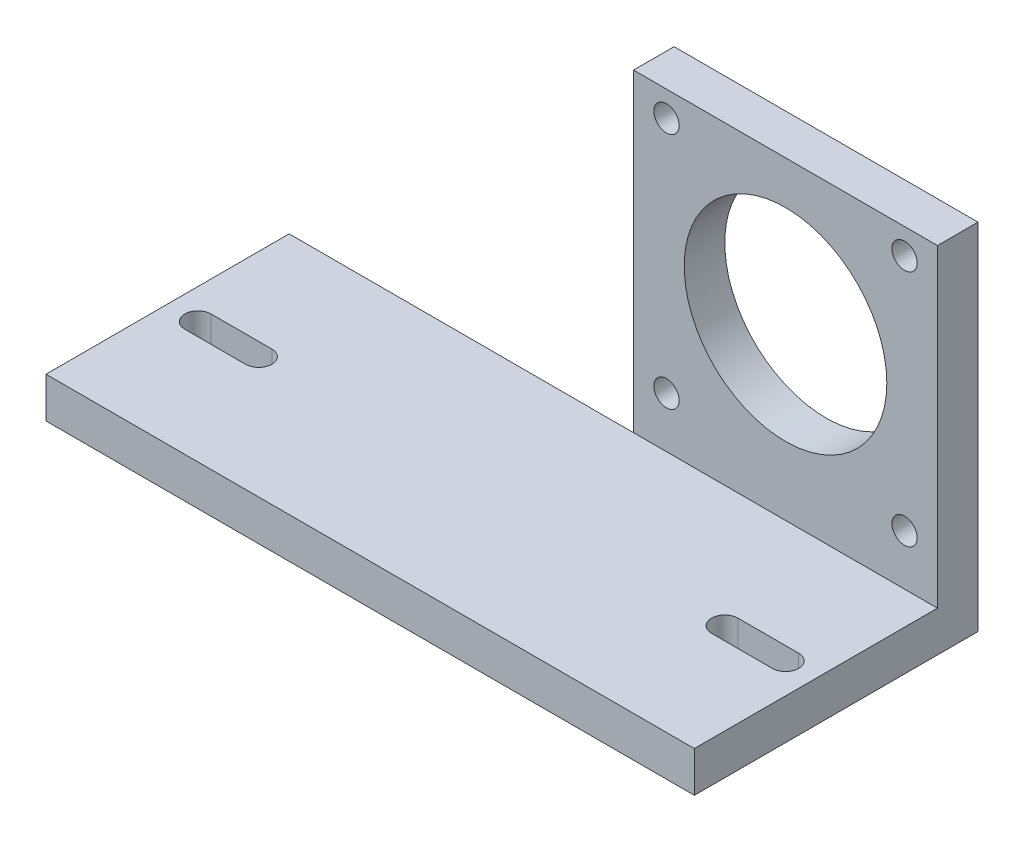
ISO-10303-21;
HEADER;
FILE_DESCRIPTION(('STEP AP214'),'2;1');
FILE_NAME('part.step','',(''),(''),'','','');
FILE_SCHEMA(('AUTOMOTIVE_DESIGN { 1 0 10303 214 1 1 1 1 }'));
ENDSEC;
DATA;
#1=APPLICATION_CONTEXT('core data for automotive mechanical design processes');
#2=APPLICATION_PROTOCOL_DEFINITION('international standard','automotive_design',2000,#1);
#3=PRODUCT_CONTEXT('',#1,'mechanical');
#4=PRODUCT('Part','Part','',(#3));
#5=PRODUCT_RELATED_PRODUCT_CATEGORY('part','',(#4));
#6=PRODUCT_DEFINITION_FORMATION('','',#4);
#7=PRODUCT_DEFINITION_CONTEXT('part definition',#1,'design');
#8=PRODUCT_DEFINITION('design','',#6,#7);
#9=PRODUCT_DEFINITION_SHAPE('','',#8);
#10=(LENGTH_UNIT() NAMED_UNIT(*) SI_UNIT(.MILLI.,.METRE.));
#11=(NAMED_UNIT(*) PLANE_ANGLE_UNIT() SI_UNIT($,.RADIAN.));
#12=(NAMED_UNIT(*) SI_UNIT($,.STERADIAN.) SOLID_ANGLE_UNIT());
#13=UNCERTAINTY_MEASURE_WITH_UNIT(LENGTH_MEASURE(1.E-05),#10,'distance_accuracy_value','');
#14=(GEOMETRIC_REPRESENTATION_CONTEXT(3) GLOBAL_UNCERTAINTY_ASSIGNED_CONTEXT((#13)) GLOBAL_UNIT_ASSIGNED_CONTEXT((#10,
#11,#12)) REPRESENTATION_CONTEXT('',''));
#15=CARTESIAN_POINT('',(0.,0.,0.));
#16=DIRECTION('',(0.,0.,1.));
#17=DIRECTION('',(1.,0.,0.));
#18=AXIS2_PLACEMENT_3D('',#15,#16,#17);
#19=CARTESIAN_POINT('',(0.,0.,8.));
#20=DIRECTION('',(0.,0.,1.));
#21=DIRECTION('',(1.,0.,0.));
#22=AXIS2_PLACEMENT_3D('',#19,#20,#21);
#23=PLANE('',#22);
#24=DIRECTION('',(-1.,0.,0.));
#25=VECTOR('',#24,1.);
#26=CARTESIAN_POINT('',(-98.,-33.5,8.));
#27=LINE('',#26,#25);
#28=CARTESIAN_POINT('',(30.,-33.5,8.));
#29=VERTEX_POINT('',#28);
#30=CARTESIAN_POINT('',(-30.,-33.5,8.));
#31=VERTEX_POINT('',#30);
#32=EDGE_CURVE('E218',#29,#31,#27,.T.);
#33=ORIENTED_EDGE('',*,*,#32,.F.);
#34=DIRECTION('',(0.,1.,0.));
#35=VECTOR('',#34,1.);
#36=CARTESIAN_POINT('',(30.,28.5,8.));
#37=LINE('',#36,#35);
#38=CARTESIAN_POINT('',(30.,28.5,8.));
#39=VERTEX_POINT('',#38);
#40=EDGE_CURVE('E275',#29,#39,#37,.T.);
#41=ORIENTED_EDGE('',*,*,#40,.T.);
#42=DIRECTION('',(-1.,0.,0.));
#43=VECTOR('',#42,1.);
#44=CARTESIAN_POINT('',(-30.,28.5,8.));
#45=LINE('',#44,#43);
#46=CARTESIAN_POINT('',(-30.,28.5,8.));
#47=VERTEX_POINT('',#46);
#48=EDGE_CURVE('E278',#39,#47,#45,.T.);
#49=ORIENTED_EDGE('',*,*,#48,.T.);
#50=DIRECTION('',(0.,-1.,0.));
#51=VECTOR('',#50,1.);
#52=CARTESIAN_POINT('',(-30.,28.5,8.));
#53=LINE('',#52,#51);
#54=EDGE_CURVE('E273',#47,#31,#53,.T.);
#55=ORIENTED_EDGE('',*,*,#54,.T.);
#56=EDGE_LOOP('',(#33,#41,#49,#55));
#57=FACE_BOUND('',#56,.T.);
#58=CARTESIAN_POINT('',(23.5,-23.5,8.));
#59=DIRECTION('',(0.,0.,1.));
#60=DIRECTION('',(1.,0.,0.));
#61=AXIS2_PLACEMENT_3D('',#58,#59,#60);
#62=CIRCLE('',#61,2.49999999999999);
#63=CARTESIAN_POINT('',(26.,-23.5,8.));
#64=VERTEX_POINT('',#63);
#65=EDGE_CURVE('E249',#64,#64,#62,.T.);
#66=ORIENTED_EDGE('',*,*,#65,.F.);
#67=EDGE_LOOP('',(#66));
#68=FACE_BOUND('',#67,.T.);
#69=CARTESIAN_POINT('',(23.5,23.5,8.));
#70=DIRECTION('',(0.,0.,1.));
#71=DIRECTION('',(1.,0.,0.));
#72=AXIS2_PLACEMENT_3D('',#69,#70,#71);
#73=CIRCLE('',#72,2.49999999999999);
#74=CARTESIAN_POINT('',(26.,23.5,8.));
#75=VERTEX_POINT('',#74);
#76=EDGE_CURVE('E261',#75,#75,#73,.T.);
#77=ORIENTED_EDGE('',*,*,#76,.F.);
#78=EDGE_LOOP('',(#77));
#79=FACE_BOUND('',#78,.T.);
#80=CARTESIAN_POINT('',(-23.5,23.5,8.));
#81=DIRECTION('',(0.,0.,1.));
#82=DIRECTION('',(1.,0.,0.));
#83=AXIS2_PLACEMENT_3D('',#80,#81,#82);
#84=CIRCLE('',#83,2.50000000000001);
#85=CARTESIAN_POINT('',(-21.,23.5,8.));
#86=VERTEX_POINT('',#85);
#87=EDGE_CURVE('E267',#86,#86,#84,.T.);
#88=ORIENTED_EDGE('',*,*,#87,.F.);
#89=EDGE_LOOP('',(#88));
#90=FACE_BOUND('',#89,.T.);
#91=CARTESIAN_POINT('',(-23.5,-23.5,8.));
#92=DIRECTION('',(0.,0.,1.));
#93=DIRECTION('',(1.,0.,0.));
#94=AXIS2_PLACEMENT_3D('',#91,#92,#93);
#95=CIRCLE('',#94,2.49999999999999);
#96=CARTESIAN_POINT('',(-21.,-23.5,8.));
#97=VERTEX_POINT('',#96);
#98=EDGE_CURVE('E255',#97,#97,#95,.T.);
#99=ORIENTED_EDGE('',*,*,#98,.F.);
#100=EDGE_LOOP('',(#99));
#101=FACE_BOUND('',#100,.T.);
#102=CARTESIAN_POINT('',(0.,0.,8.));
#103=DIRECTION('',(0.,0.,1.));
#104=DIRECTION('',(1.,0.,0.));
#105=AXIS2_PLACEMENT_3D('',#102,#103,#104);
#106=CIRCLE('',#105,20.);
#107=CARTESIAN_POINT('',(20.,0.,8.));
#108=VERTEX_POINT('',#107);
#109=EDGE_CURVE('E243',#108,#108,#106,.T.);
#110=ORIENTED_EDGE('',*,*,#109,.F.);
#111=EDGE_LOOP('',(#110));
#112=FACE_BOUND('',#111,.T.);
#113=ADVANCED_FACE('F35',(#57,#68,#79,#90,#101,#112),#23,.T.);
#114=CARTESIAN_POINT('',(0.,0.,0.));
#115=DIRECTION('',(0.,0.,1.));
#116=DIRECTION('',(1.,0.,0.));
#117=AXIS2_PLACEMENT_3D('',#114,#115,#116);
#118=PLANE('',#117);
#119=DIRECTION('',(0.,-1.,0.));
#120=VECTOR('',#119,1.);
#121=CARTESIAN_POINT('',(-30.,28.5,0.));
#122=LINE('',#121,#120);
#123=CARTESIAN_POINT('',(-30.,28.5,0.));
#124=VERTEX_POINT('',#123);
#125=CARTESIAN_POINT('',(-30.,-41.5,0.));
#126=VERTEX_POINT('',#125);
#127=EDGE_CURVE('E270',#124,#126,#122,.T.);
#128=ORIENTED_EDGE('',*,*,#127,.F.);
#129=DIRECTION('',(-1.,0.,0.));
#130=VECTOR('',#129,1.);
#131=CARTESIAN_POINT('',(-30.,28.5,0.));
#132=LINE('',#131,#130);
#133=CARTESIAN_POINT('',(30.,28.5,0.));
#134=VERTEX_POINT('',#133);
#135=EDGE_CURVE('E287',#134,#124,#132,.T.);
#136=ORIENTED_EDGE('',*,*,#135,.F.);
#137=DIRECTION('',(0.,1.,0.));
#138=VECTOR('',#137,1.);
#139=CARTESIAN_POINT('',(30.,28.5,0.));
#140=LINE('',#139,#138);
#141=CARTESIAN_POINT('',(30.,-41.5,0.));
#142=VERTEX_POINT('',#141);
#143=EDGE_CURVE('E285',#142,#134,#140,.T.);
#144=ORIENTED_EDGE('',*,*,#143,.F.);
#145=DIRECTION('',(1.,0.,0.));
#146=VECTOR('',#145,1.);
#147=CARTESIAN_POINT('',(-30.,-41.5,0.));
#148=LINE('',#147,#146);
#149=EDGE_CURVE('E283',#126,#142,#148,.T.);
#150=ORIENTED_EDGE('',*,*,#149,.F.);
#151=EDGE_LOOP('',(#128,#136,#144,#150));
#152=FACE_BOUND('',#151,.T.);
#153=CARTESIAN_POINT('',(-23.5,23.5,0.));
#154=DIRECTION('',(0.,0.,1.));
#155=DIRECTION('',(1.,0.,0.));
#156=AXIS2_PLACEMENT_3D('',#153,#154,#155);
#157=CIRCLE('',#156,2.50000000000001);
#158=CARTESIAN_POINT('',(-21.,23.5,0.));
#159=VERTEX_POINT('',#158);
#160=EDGE_CURVE('E264',#159,#159,#157,.T.);
#161=ORIENTED_EDGE('',*,*,#160,.T.);
#162=EDGE_LOOP('',(#161));
#163=FACE_BOUND('',#162,.T.);
#164=CARTESIAN_POINT('',(23.5,23.5,0.));
#165=DIRECTION('',(0.,0.,1.));
#166=DIRECTION('',(1.,0.,0.));
#167=AXIS2_PLACEMENT_3D('',#164,#165,#166);
#168=CIRCLE('',#167,2.49999999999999);
#169=CARTESIAN_POINT('',(26.,23.5,0.));
#170=VERTEX_POINT('',#169);
#171=EDGE_CURVE('E258',#170,#170,#168,.T.);
#172=ORIENTED_EDGE('',*,*,#171,.T.);
#173=EDGE_LOOP('',(#172));
#174=FACE_BOUND('',#173,.T.);
#175=CARTESIAN_POINT('',(-23.5,-23.5,0.));
#176=DIRECTION('',(0.,0.,1.));
#177=DIRECTION('',(1.,0.,0.));
#178=AXIS2_PLACEMENT_3D('',#175,#176,#177);
#179=CIRCLE('',#178,2.49999999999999);
#180=CARTESIAN_POINT('',(-21.,-23.5,0.));
#181=VERTEX_POINT('',#180);
#182=EDGE_CURVE('E252',#181,#181,#179,.T.);
#183=ORIENTED_EDGE('',*,*,#182,.T.);
#184=EDGE_LOOP('',(#183));
#185=FACE_BOUND('',#184,.T.);
#186=CARTESIAN_POINT('',(23.5,-23.5,0.));
#187=DIRECTION('',(0.,0.,1.));
#188=DIRECTION('',(1.,0.,0.));
#189=AXIS2_PLACEMENT_3D('',#186,#187,#188);
#190=CIRCLE('',#189,2.49999999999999);
#191=CARTESIAN_POINT('',(26.,-23.5,0.));
#192=VERTEX_POINT('',#191);
#193=EDGE_CURVE('E246',#192,#192,#190,.T.);
#194=ORIENTED_EDGE('',*,*,#193,.T.);
#195=EDGE_LOOP('',(#194));
#196=FACE_BOUND('',#195,.T.);
#197=CARTESIAN_POINT('',(0.,0.,0.));
#198=DIRECTION('',(0.,0.,1.));
#199=DIRECTION('',(1.,0.,0.));
#200=AXIS2_PLACEMENT_3D('',#197,#198,#199);
#201=CIRCLE('',#200,20.);
#202=CARTESIAN_POINT('',(20.,0.,0.));
#203=VERTEX_POINT('',#202);
#204=EDGE_CURVE('E242',#203,#203,#201,.T.);
#205=ORIENTED_EDGE('',*,*,#204,.T.);
#206=EDGE_LOOP('',(#205));
#207=FACE_BOUND('',#206,.T.);
#208=ADVANCED_FACE('F304',(#152,#163,#174,#185,#196,#207),#118,.F.);
#209=CARTESIAN_POINT('',(-30.,28.5,8.));
#210=DIRECTION('',(1.,0.,0.));
#211=DIRECTION('',(0.,0.,-1.));
#212=AXIS2_PLACEMENT_3D('',#209,#210,#211);
#213=PLANE('',#212);
#214=ORIENTED_EDGE('',*,*,#127,.T.);
#215=DIRECTION('',(0.,0.,-1.));
#216=VECTOR('',#215,1.);
#217=CARTESIAN_POINT('',(-30.,-41.5,8.));
#218=LINE('',#217,#216);
#219=CARTESIAN_POINT('',(-30.,-41.5,8.));
#220=VERTEX_POINT('',#219);
#221=EDGE_CURVE('E11',#220,#126,#218,.T.);
#222=ORIENTED_EDGE('',*,*,#221,.F.);
#223=EDGE_CURVE('E276',#31,#220,#53,.T.);
#224=ORIENTED_EDGE('',*,*,#223,.F.);
#225=ORIENTED_EDGE('',*,*,#54,.F.);
#226=DIRECTION('',(0.,0.,-1.));
#227=VECTOR('',#226,1.);
#228=CARTESIAN_POINT('',(-30.,28.5,8.));
#229=LINE('',#228,#227);
#230=EDGE_CURVE('E280',#47,#124,#229,.T.);
#231=ORIENTED_EDGE('',*,*,#230,.T.);
#232=EDGE_LOOP('',(#214,#222,#224,#225,#231));
#233=FACE_BOUND('',#232,.T.);
#234=ADVANCED_FACE('F37',(#233),#213,.F.);
#235=CARTESIAN_POINT('',(-30.,-41.5,8.));
#236=DIRECTION('',(0.,1.,0.));
#237=DIRECTION('',(0.,0.,1.));
#238=AXIS2_PLACEMENT_3D('',#235,#236,#237);
#239=PLANE('',#238);
#240=DIRECTION('',(-1.,0.,0.));
#241=VECTOR('',#240,1.);
#242=CARTESIAN_POINT('',(24.,-41.5,29.4));
#243=LINE('',#242,#241);
#244=CARTESIAN_POINT('',(24.,-41.5,29.4));
#245=VERTEX_POINT('',#244);
#246=CARTESIAN_POINT('',(12.,-41.5,29.4));
#247=VERTEX_POINT('',#246);
#248=EDGE_CURVE('E153',#245,#247,#243,.T.);
#249=ORIENTED_EDGE('',*,*,#248,.T.);
#250=CARTESIAN_POINT('',(12.,-41.5,32.));
#251=DIRECTION('',(0.,1.,0.));
#252=DIRECTION('',(0.,0.,1.));
#253=AXIS2_PLACEMENT_3D('',#250,#251,#252);
#254=CIRCLE('',#253,2.6);
#255=CARTESIAN_POINT('',(12.,-41.5,34.6));
#256=VERTEX_POINT('',#255);
#257=EDGE_CURVE('E147',#247,#256,#254,.T.);
#258=ORIENTED_EDGE('',*,*,#257,.T.);
#259=DIRECTION('',(1.,0.,0.));
#260=VECTOR('',#259,1.);
#261=CARTESIAN_POINT('',(24.,-41.5,34.6));
#262=LINE('',#261,#260);
#263=CARTESIAN_POINT('',(24.,-41.5,34.6));
#264=VERTEX_POINT('',#263);
#265=EDGE_CURVE('E156',#256,#264,#262,.T.);
#266=ORIENTED_EDGE('',*,*,#265,.T.);
#267=CARTESIAN_POINT('',(24.,-41.5,32.));
#268=DIRECTION('',(0.,1.,0.));
#269=DIRECTION('',(0.,0.,-1.));
#270=AXIS2_PLACEMENT_3D('',#267,#268,#269);
#271=CIRCLE('',#270,2.6);
#272=EDGE_CURVE('E50',#264,#245,#271,.T.);
#273=ORIENTED_EDGE('',*,*,#272,.T.);
#274=EDGE_LOOP('',(#249,#258,#266,#273));
#275=FACE_BOUND('',#274,.T.);
#276=DIRECTION('',(-1.,0.,0.));
#277=VECTOR('',#276,1.);
#278=CARTESIAN_POINT('',(-92.,-41.5,29.4));
#279=LINE('',#278,#277);
#280=CARTESIAN_POINT('',(-80.,-41.5,29.4));
#281=VERTEX_POINT('',#280);
#282=CARTESIAN_POINT('',(-92.,-41.5,29.4));
#283=VERTEX_POINT('',#282);
#284=EDGE_CURVE('E192',#281,#283,#279,.T.);
#285=ORIENTED_EDGE('',*,*,#284,.T.);
#286=CARTESIAN_POINT('',(-92.,-41.5,32.));
#287=DIRECTION('',(0.,1.,0.));
#288=DIRECTION('',(0.,0.,1.));
#289=AXIS2_PLACEMENT_3D('',#286,#287,#288);
#290=CIRCLE('',#289,2.6);
#291=CARTESIAN_POINT('',(-92.,-41.5,34.6));
#292=VERTEX_POINT('',#291);
#293=EDGE_CURVE('E182',#283,#292,#290,.T.);
#294=ORIENTED_EDGE('',*,*,#293,.T.);
#295=DIRECTION('',(1.,0.,0.));
#296=VECTOR('',#295,1.);
#297=CARTESIAN_POINT('',(-92.,-41.5,34.6));
#298=LINE('',#297,#296);
#299=CARTESIAN_POINT('',(-80.,-41.5,34.6));
#300=VERTEX_POINT('',#299);
#301=EDGE_CURVE('E185',#292,#300,#298,.T.);
#302=ORIENTED_EDGE('',*,*,#301,.T.);
#303=CARTESIAN_POINT('',(-80.,-41.5,32.));
#304=DIRECTION('',(0.,1.,0.));
#305=DIRECTION('',(0.,0.,-1.));
#306=AXIS2_PLACEMENT_3D('',#303,#304,#305);
#307=CIRCLE('',#306,2.6);
#308=EDGE_CURVE('E189',#300,#281,#307,.T.);
#309=ORIENTED_EDGE('',*,*,#308,.T.);
#310=EDGE_LOOP('',(#285,#294,#302,#309));
#311=FACE_BOUND('',#310,.T.);
#312=ORIENTED_EDGE('',*,*,#149,.T.);
#313=DIRECTION('',(0.,0.,-1.));
#314=VECTOR('',#313,1.);
#315=CARTESIAN_POINT('',(30.,-41.5,8.));
#316=LINE('',#315,#314);
#317=CARTESIAN_POINT('',(30.,-41.5,56.));
#318=VERTEX_POINT('',#317);
#319=EDGE_CURVE('E43',#318,#142,#316,.T.);
#320=ORIENTED_EDGE('',*,*,#319,.F.);
#321=DIRECTION('',(1.,0.,0.));
#322=VECTOR('',#321,1.);
#323=CARTESIAN_POINT('',(-98.,-41.5,56.));
#324=LINE('',#323,#322);
#325=CARTESIAN_POINT('',(-98.,-41.5,56.));
#326=VERTEX_POINT('',#325);
#327=EDGE_CURVE('E217',#326,#318,#324,.T.);
#328=ORIENTED_EDGE('',*,*,#327,.F.);
#329=DIRECTION('',(0.,0.,-1.));
#330=VECTOR('',#329,1.);
#331=CARTESIAN_POINT('',(-98.,-41.5,56.));
#332=LINE('',#331,#330);
#333=CARTESIAN_POINT('',(-98.,-41.5,8.));
#334=VERTEX_POINT('',#333);
#335=EDGE_CURVE('E239',#326,#334,#332,.T.);
#336=ORIENTED_EDGE('',*,*,#335,.T.);
#337=DIRECTION('',(1.,0.,0.));
#338=VECTOR('',#337,1.);
#339=CARTESIAN_POINT('',(-98.,-41.5,8.));
#340=LINE('',#339,#338);
#341=EDGE_CURVE('E228',#334,#220,#340,.T.);
#342=ORIENTED_EDGE('',*,*,#341,.T.);
#343=ORIENTED_EDGE('',*,*,#221,.T.);
#344=EDGE_LOOP('',(#312,#320,#328,#336,#342,#343));
#345=FACE_BOUND('',#344,.T.);
#346=ADVANCED_FACE('F160',(#275,#311,#345),#239,.F.);
#347=CARTESIAN_POINT('',(30.,28.5,8.));
#348=DIRECTION('',(-1.,0.,0.));
#349=DIRECTION('',(0.,0.,1.));
#350=AXIS2_PLACEMENT_3D('',#347,#348,#349);
#351=PLANE('',#350);
#352=ORIENTED_EDGE('',*,*,#143,.T.);
#353=DIRECTION('',(0.,0.,-1.));
#354=VECTOR('',#353,1.);
#355=CARTESIAN_POINT('',(30.,28.5,8.));
#356=LINE('',#355,#354);
#357=EDGE_CURVE('E291',#39,#134,#356,.T.);
#358=ORIENTED_EDGE('',*,*,#357,.F.);
#359=ORIENTED_EDGE('',*,*,#40,.F.);
#360=DIRECTION('',(0.,0.,-1.));
#361=VECTOR('',#360,1.);
#362=CARTESIAN_POINT('',(30.,-33.5,56.));
#363=LINE('',#362,#361);
#364=CARTESIAN_POINT('',(30.,-33.5,56.));
#365=VERTEX_POINT('',#364);
#366=EDGE_CURVE('E236',#365,#29,#363,.T.);
#367=ORIENTED_EDGE('',*,*,#366,.F.);
#368=DIRECTION('',(0.,1.,0.));
#369=VECTOR('',#368,1.);
#370=CARTESIAN_POINT('',(30.,-41.5,56.));
#371=LINE('',#370,#369);
#372=EDGE_CURVE('E221',#318,#365,#371,.T.);
#373=ORIENTED_EDGE('',*,*,#372,.F.);
#374=ORIENTED_EDGE('',*,*,#319,.T.);
#375=EDGE_LOOP('',(#352,#358,#359,#367,#373,#374));
#376=FACE_BOUND('',#375,.T.);
#377=ADVANCED_FACE('F297',(#376),#351,.F.);
#378=CARTESIAN_POINT('',(-30.,28.5,8.));
#379=DIRECTION('',(0.,-1.,0.));
#380=DIRECTION('',(0.,0.,-1.));
#381=AXIS2_PLACEMENT_3D('',#378,#379,#380);
#382=PLANE('',#381);
#383=ORIENTED_EDGE('',*,*,#135,.T.);
#384=ORIENTED_EDGE('',*,*,#230,.F.);
#385=ORIENTED_EDGE('',*,*,#48,.F.);
#386=ORIENTED_EDGE('',*,*,#357,.T.);
#387=EDGE_LOOP('',(#383,#384,#385,#386));
#388=FACE_BOUND('',#387,.T.);
#389=ADVANCED_FACE('F308',(#388),#382,.F.);
#390=CARTESIAN_POINT('',(-23.5,23.5,8.));
#391=DIRECTION('',(0.,0.,-1.));
#392=DIRECTION('',(-1.,0.,0.));
#393=AXIS2_PLACEMENT_3D('',#390,#391,#392);
#394=CYLINDRICAL_SURFACE('',#393,2.50000000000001);
#395=ORIENTED_EDGE('',*,*,#87,.T.);
#396=EDGE_LOOP('',(#395));
#397=FACE_BOUND('',#396,.T.);
#398=ORIENTED_EDGE('',*,*,#160,.F.);
#399=EDGE_LOOP('',(#398));
#400=FACE_BOUND('',#399,.T.);
#401=ADVANCED_FACE('F350',(#397,#400),#394,.F.);
#402=CARTESIAN_POINT('',(23.5,23.5,8.));
#403=DIRECTION('',(0.,0.,-1.));
#404=DIRECTION('',(-1.,0.,0.));
#405=AXIS2_PLACEMENT_3D('',#402,#403,#404);
#406=CYLINDRICAL_SURFACE('',#405,2.49999999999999);
#407=ORIENTED_EDGE('',*,*,#76,.T.);
#408=EDGE_LOOP('',(#407));
#409=FACE_BOUND('',#408,.T.);
#410=ORIENTED_EDGE('',*,*,#171,.F.);
#411=EDGE_LOOP('',(#410));
#412=FACE_BOUND('',#411,.T.);
#413=ADVANCED_FACE('F384',(#409,#412),#406,.F.);
#414=CARTESIAN_POINT('',(-23.5,-23.5,8.));
#415=DIRECTION('',(0.,0.,-1.));
#416=DIRECTION('',(-1.,0.,0.));
#417=AXIS2_PLACEMENT_3D('',#414,#415,#416);
#418=CYLINDRICAL_SURFACE('',#417,2.49999999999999);
#419=ORIENTED_EDGE('',*,*,#98,.T.);
#420=EDGE_LOOP('',(#419));
#421=FACE_BOUND('',#420,.T.);
#422=ORIENTED_EDGE('',*,*,#182,.F.);
#423=EDGE_LOOP('',(#422));
#424=FACE_BOUND('',#423,.T.);
#425=ADVANCED_FACE('F393',(#421,#424),#418,.F.);
#426=CARTESIAN_POINT('',(23.5,-23.5,8.));
#427=DIRECTION('',(0.,0.,-1.));
#428=DIRECTION('',(-1.,0.,0.));
#429=AXIS2_PLACEMENT_3D('',#426,#427,#428);
#430=CYLINDRICAL_SURFACE('',#429,2.49999999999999);
#431=ORIENTED_EDGE('',*,*,#65,.T.);
#432=EDGE_LOOP('',(#431));
#433=FACE_BOUND('',#432,.T.);
#434=ORIENTED_EDGE('',*,*,#193,.F.);
#435=EDGE_LOOP('',(#434));
#436=FACE_BOUND('',#435,.T.);
#437=ADVANCED_FACE('F402',(#433,#436),#430,.F.);
#438=CARTESIAN_POINT('',(0.,0.,8.));
#439=DIRECTION('',(0.,0.,-1.));
#440=DIRECTION('',(-1.,0.,0.));
#441=AXIS2_PLACEMENT_3D('',#438,#439,#440);
#442=CYLINDRICAL_SURFACE('',#441,20.);
#443=ORIENTED_EDGE('',*,*,#109,.T.);
#444=EDGE_LOOP('',(#443));
#445=FACE_BOUND('',#444,.T.);
#446=ORIENTED_EDGE('',*,*,#204,.F.);
#447=EDGE_LOOP('',(#446));
#448=FACE_BOUND('',#447,.T.);
#449=ADVANCED_FACE('F412',(#445,#448),#442,.F.);
#450=CARTESIAN_POINT('',(-98.,-41.5,56.));
#451=DIRECTION('',(1.,0.,0.));
#452=DIRECTION('',(0.,0.,-1.));
#453=AXIS2_PLACEMENT_3D('',#450,#451,#452);
#454=PLANE('',#453);
#455=DIRECTION('',(0.,-1.,0.));
#456=VECTOR('',#455,1.);
#457=CARTESIAN_POINT('',(-98.,-41.5,8.));
#458=LINE('',#457,#456);
#459=CARTESIAN_POINT('',(-98.,-33.5,8.));
#460=VERTEX_POINT('',#459);
#461=EDGE_CURVE('E207',#460,#334,#458,.T.);
#462=ORIENTED_EDGE('',*,*,#461,.T.);
#463=ORIENTED_EDGE('',*,*,#335,.F.);
#464=DIRECTION('',(0.,-1.,0.));
#465=VECTOR('',#464,1.);
#466=CARTESIAN_POINT('',(-98.,-41.5,56.));
#467=LINE('',#466,#465);
#468=CARTESIAN_POINT('',(-98.,-33.5,56.));
#469=VERTEX_POINT('',#468);
#470=EDGE_CURVE('E214',#469,#326,#467,.T.);
#471=ORIENTED_EDGE('',*,*,#470,.F.);
#472=DIRECTION('',(0.,0.,-1.));
#473=VECTOR('',#472,1.);
#474=CARTESIAN_POINT('',(-98.,-33.5,56.));
#475=LINE('',#474,#473);
#476=EDGE_CURVE('E225',#469,#460,#475,.T.);
#477=ORIENTED_EDGE('',*,*,#476,.T.);
#478=EDGE_LOOP('',(#462,#463,#471,#477));
#479=FACE_BOUND('',#478,.T.);
#480=ADVANCED_FACE('F328',(#479),#454,.F.);
#481=CARTESIAN_POINT('',(-98.,-33.5,56.));
#482=DIRECTION('',(0.,-1.,0.));
#483=DIRECTION('',(0.,0.,-1.));
#484=AXIS2_PLACEMENT_3D('',#481,#482,#483);
#485=PLANE('',#484);
#486=DIRECTION('',(1.,0.,0.));
#487=VECTOR('',#486,1.);
#488=CARTESIAN_POINT('',(24.,-33.5,34.6));
#489=LINE('',#488,#487);
#490=CARTESIAN_POINT('',(12.,-33.5,34.6));
#491=VERTEX_POINT('',#490);
#492=CARTESIAN_POINT('',(24.,-33.5,34.6));
#493=VERTEX_POINT('',#492);
#494=EDGE_CURVE('E172',#491,#493,#489,.T.);
#495=ORIENTED_EDGE('',*,*,#494,.F.);
#496=CARTESIAN_POINT('',(12.,-33.5,32.));
#497=DIRECTION('',(0.,1.,0.));
#498=DIRECTION('',(0.,0.,1.));
#499=AXIS2_PLACEMENT_3D('',#496,#497,#498);
#500=CIRCLE('',#499,2.6);
#501=CARTESIAN_POINT('',(12.,-33.5,29.4));
#502=VERTEX_POINT('',#501);
#503=EDGE_CURVE('E58',#502,#491,#500,.T.);
#504=ORIENTED_EDGE('',*,*,#503,.F.);
#505=DIRECTION('',(-1.,0.,0.));
#506=VECTOR('',#505,1.);
#507=CARTESIAN_POINT('',(24.,-33.5,29.4));
#508=LINE('',#507,#506);
#509=CARTESIAN_POINT('',(24.,-33.5,29.4));
#510=VERTEX_POINT('',#509);
#511=EDGE_CURVE('E163',#510,#502,#508,.T.);
#512=ORIENTED_EDGE('',*,*,#511,.F.);
#513=CARTESIAN_POINT('',(24.,-33.5,32.));
#514=DIRECTION('',(0.,1.,0.));
#515=DIRECTION('',(0.,0.,-1.));
#516=AXIS2_PLACEMENT_3D('',#513,#514,#515);
#517=CIRCLE('',#516,2.6);
#518=EDGE_CURVE('E166',#493,#510,#517,.T.);
#519=ORIENTED_EDGE('',*,*,#518,.F.);
#520=EDGE_LOOP('',(#495,#504,#512,#519));
#521=FACE_BOUND('',#520,.T.);
#522=DIRECTION('',(1.,0.,0.));
#523=VECTOR('',#522,1.);
#524=CARTESIAN_POINT('',(-92.,-33.5,34.6));
#525=LINE('',#524,#523);
#526=CARTESIAN_POINT('',(-92.,-33.5,34.6));
#527=VERTEX_POINT('',#526);
#528=CARTESIAN_POINT('',(-80.,-33.5,34.6));
#529=VERTEX_POINT('',#528);
#530=EDGE_CURVE('E197',#527,#529,#525,.T.);
#531=ORIENTED_EDGE('',*,*,#530,.F.);
#532=CARTESIAN_POINT('',(-92.,-33.5,32.));
#533=DIRECTION('',(0.,1.,0.));
#534=DIRECTION('',(0.,0.,1.));
#535=AXIS2_PLACEMENT_3D('',#532,#533,#534);
#536=CIRCLE('',#535,2.6);
#537=CARTESIAN_POINT('',(-92.,-33.5,29.4));
#538=VERTEX_POINT('',#537);
#539=EDGE_CURVE('E178',#538,#527,#536,.T.);
#540=ORIENTED_EDGE('',*,*,#539,.F.);
#541=DIRECTION('',(-1.,0.,0.));
#542=VECTOR('',#541,1.);
#543=CARTESIAN_POINT('',(-92.,-33.5,29.4));
#544=LINE('',#543,#542);
#545=CARTESIAN_POINT('',(-80.,-33.5,29.4));
#546=VERTEX_POINT('',#545);
#547=EDGE_CURVE('E186',#546,#538,#544,.T.);
#548=ORIENTED_EDGE('',*,*,#547,.F.);
#549=CARTESIAN_POINT('',(-80.,-33.5,32.));
#550=DIRECTION('',(0.,1.,0.));
#551=DIRECTION('',(0.,0.,-1.));
#552=AXIS2_PLACEMENT_3D('',#549,#550,#551);
#553=CIRCLE('',#552,2.6);
#554=EDGE_CURVE('E200',#529,#546,#553,.T.);
#555=ORIENTED_EDGE('',*,*,#554,.F.);
#556=EDGE_LOOP('',(#531,#540,#548,#555));
#557=FACE_BOUND('',#556,.T.);
#558=ORIENTED_EDGE('',*,*,#32,.T.);
#559=EDGE_CURVE('E231',#31,#460,#27,.T.);
#560=ORIENTED_EDGE('',*,*,#559,.T.);
#561=ORIENTED_EDGE('',*,*,#476,.F.);
#562=DIRECTION('',(-1.,0.,0.));
#563=VECTOR('',#562,1.);
#564=CARTESIAN_POINT('',(-98.,-33.5,56.));
#565=LINE('',#564,#563);
#566=EDGE_CURVE('E223',#365,#469,#565,.T.);
#567=ORIENTED_EDGE('',*,*,#566,.F.);
#568=ORIENTED_EDGE('',*,*,#366,.T.);
#569=EDGE_LOOP('',(#558,#560,#561,#567,#568));
#570=FACE_BOUND('',#569,.T.);
#571=ADVANCED_FACE('F320',(#521,#557,#570),#485,.F.);
#572=CARTESIAN_POINT('',(0.,0.,56.));
#573=DIRECTION('',(0.,0.,-1.));
#574=DIRECTION('',(-1.,0.,0.));
#575=AXIS2_PLACEMENT_3D('',#572,#573,#574);
#576=PLANE('',#575);
#577=ORIENTED_EDGE('',*,*,#470,.T.);
#578=ORIENTED_EDGE('',*,*,#327,.T.);
#579=ORIENTED_EDGE('',*,*,#372,.T.);
#580=ORIENTED_EDGE('',*,*,#566,.T.);
#581=EDGE_LOOP('',(#577,#578,#579,#580));
#582=FACE_BOUND('',#581,.T.);
#583=ADVANCED_FACE('F324',(#582),#576,.F.);
#584=CARTESIAN_POINT('',(0.,0.,8.));
#585=DIRECTION('',(0.,0.,-1.));
#586=DIRECTION('',(-1.,0.,0.));
#587=AXIS2_PLACEMENT_3D('',#584,#585,#586);
#588=PLANE('',#587);
#589=ORIENTED_EDGE('',*,*,#559,.F.);
#590=ORIENTED_EDGE('',*,*,#223,.T.);
#591=ORIENTED_EDGE('',*,*,#341,.F.);
#592=ORIENTED_EDGE('',*,*,#461,.F.);
#593=EDGE_LOOP('',(#589,#590,#591,#592));
#594=FACE_BOUND('',#593,.T.);
#595=ADVANCED_FACE('F330',(#594),#588,.T.);
#596=CARTESIAN_POINT('',(-92.,-41.5,32.));
#597=DIRECTION('',(0.,1.,0.));
#598=DIRECTION('',(0.,0.,1.));
#599=AXIS2_PLACEMENT_3D('',#596,#597,#598);
#600=CYLINDRICAL_SURFACE('',#599,2.6);
#601=ORIENTED_EDGE('',*,*,#539,.T.);
#602=DIRECTION('',(0.,1.,0.));
#603=VECTOR('',#602,1.);
#604=CARTESIAN_POINT('',(-92.,-41.5,34.6));
#605=LINE('',#604,#603);
#606=EDGE_CURVE('E195',#292,#527,#605,.T.);
#607=ORIENTED_EDGE('',*,*,#606,.F.);
#608=ORIENTED_EDGE('',*,*,#293,.F.);
#609=DIRECTION('',(0.,1.,0.));
#610=VECTOR('',#609,1.);
#611=CARTESIAN_POINT('',(-92.,-41.5,29.4));
#612=LINE('',#611,#610);
#613=EDGE_CURVE('E205',#283,#538,#612,.T.);
#614=ORIENTED_EDGE('',*,*,#613,.T.);
#615=EDGE_LOOP('',(#601,#607,#608,#614));
#616=FACE_BOUND('',#615,.T.);
#617=ADVANCED_FACE('F332',(#616),#600,.F.);
#618=CARTESIAN_POINT('',(-92.,-41.5,29.4));
#619=DIRECTION('',(0.,0.,-1.));
#620=DIRECTION('',(-1.,0.,0.));
#621=AXIS2_PLACEMENT_3D('',#618,#619,#620);
#622=PLANE('',#621);
#623=ORIENTED_EDGE('',*,*,#547,.T.);
#624=ORIENTED_EDGE('',*,*,#613,.F.);
#625=ORIENTED_EDGE('',*,*,#284,.F.);
#626=DIRECTION('',(0.,1.,0.));
#627=VECTOR('',#626,1.);
#628=CARTESIAN_POINT('',(-80.,-41.5,29.4));
#629=LINE('',#628,#627);
#630=EDGE_CURVE('E208',#281,#546,#629,.T.);
#631=ORIENTED_EDGE('',*,*,#630,.T.);
#632=EDGE_LOOP('',(#623,#624,#625,#631));
#633=FACE_BOUND('',#632,.T.);
#634=ADVANCED_FACE('F338',(#633),#622,.F.);
#635=CARTESIAN_POINT('',(-80.,-41.5,32.));
#636=DIRECTION('',(0.,1.,0.));
#637=DIRECTION('',(0.,0.,1.));
#638=AXIS2_PLACEMENT_3D('',#635,#636,#637);
#639=CYLINDRICAL_SURFACE('',#638,2.6);
#640=ORIENTED_EDGE('',*,*,#554,.T.);
#641=ORIENTED_EDGE('',*,*,#630,.F.);
#642=ORIENTED_EDGE('',*,*,#308,.F.);
#643=DIRECTION('',(0.,1.,0.));
#644=VECTOR('',#643,1.);
#645=CARTESIAN_POINT('',(-80.,-41.5,34.6));
#646=LINE('',#645,#644);
#647=EDGE_CURVE('E210',#300,#529,#646,.T.);
#648=ORIENTED_EDGE('',*,*,#647,.T.);
#649=EDGE_LOOP('',(#640,#641,#642,#648));
#650=FACE_BOUND('',#649,.T.);
#651=ADVANCED_FACE('F482',(#650),#639,.F.);
#652=CARTESIAN_POINT('',(-92.,-41.5,34.6));
#653=DIRECTION('',(0.,0.,1.));
#654=DIRECTION('',(1.,0.,0.));
#655=AXIS2_PLACEMENT_3D('',#652,#653,#654);
#656=PLANE('',#655);
#657=ORIENTED_EDGE('',*,*,#530,.T.);
#658=ORIENTED_EDGE('',*,*,#647,.F.);
#659=ORIENTED_EDGE('',*,*,#301,.F.);
#660=ORIENTED_EDGE('',*,*,#606,.T.);
#661=EDGE_LOOP('',(#657,#658,#659,#660));
#662=FACE_BOUND('',#661,.T.);
#663=ADVANCED_FACE('F491',(#662),#656,.F.);
#664=CARTESIAN_POINT('',(12.,-41.5,32.));
#665=DIRECTION('',(0.,1.,0.));
#666=DIRECTION('',(0.,0.,1.));
#667=AXIS2_PLACEMENT_3D('',#664,#665,#666);
#668=CYLINDRICAL_SURFACE('',#667,2.6);
#669=ORIENTED_EDGE('',*,*,#503,.T.);
#670=DIRECTION('',(0.,1.,0.));
#671=VECTOR('',#670,1.);
#672=CARTESIAN_POINT('',(12.,-41.5,34.6));
#673=LINE('',#672,#671);
#674=EDGE_CURVE('E143',#256,#491,#673,.T.);
#675=ORIENTED_EDGE('',*,*,#674,.F.);
#676=ORIENTED_EDGE('',*,*,#257,.F.);
#677=DIRECTION('',(0.,1.,0.));
#678=VECTOR('',#677,1.);
#679=CARTESIAN_POINT('',(12.,-41.5,29.4));
#680=LINE('',#679,#678);
#681=EDGE_CURVE('E176',#247,#502,#680,.T.);
#682=ORIENTED_EDGE('',*,*,#681,.T.);
#683=EDGE_LOOP('',(#669,#675,#676,#682));
#684=FACE_BOUND('',#683,.T.);
#685=ADVANCED_FACE('F145',(#684),#668,.F.);
#686=CARTESIAN_POINT('',(24.,-41.5,29.4));
#687=DIRECTION('',(0.,0.,-1.));
#688=DIRECTION('',(-1.,0.,0.));
#689=AXIS2_PLACEMENT_3D('',#686,#687,#688);
#690=PLANE('',#689);
#691=ORIENTED_EDGE('',*,*,#511,.T.);
#692=ORIENTED_EDGE('',*,*,#681,.F.);
#693=ORIENTED_EDGE('',*,*,#248,.F.);
#694=DIRECTION('',(0.,1.,0.));
#695=VECTOR('',#694,1.);
#696=CARTESIAN_POINT('',(24.,-41.5,29.4));
#697=LINE('',#696,#695);
#698=EDGE_CURVE('E179',#245,#510,#697,.T.);
#699=ORIENTED_EDGE('',*,*,#698,.T.);
#700=EDGE_LOOP('',(#691,#692,#693,#699));
#701=FACE_BOUND('',#700,.T.);
#702=ADVANCED_FACE('F508',(#701),#690,.F.);
#703=CARTESIAN_POINT('',(24.,-41.5,32.));
#704=DIRECTION('',(0.,1.,0.));
#705=DIRECTION('',(0.,0.,1.));
#706=AXIS2_PLACEMENT_3D('',#703,#704,#705);
#707=CYLINDRICAL_SURFACE('',#706,2.6);
#708=ORIENTED_EDGE('',*,*,#518,.T.);
#709=ORIENTED_EDGE('',*,*,#698,.F.);
#710=ORIENTED_EDGE('',*,*,#272,.F.);
#711=DIRECTION('',(0.,1.,0.));
#712=VECTOR('',#711,1.);
#713=CARTESIAN_POINT('',(24.,-41.5,34.6));
#714=LINE('',#713,#712);
#715=EDGE_CURVE('E152',#264,#493,#714,.T.);
#716=ORIENTED_EDGE('',*,*,#715,.T.);
#717=EDGE_LOOP('',(#708,#709,#710,#716));
#718=FACE_BOUND('',#717,.T.);
#719=ADVANCED_FACE('F516',(#718),#707,.F.);
#720=CARTESIAN_POINT('',(24.,-41.5,34.6));
#721=DIRECTION('',(0.,0.,1.));
#722=DIRECTION('',(1.,0.,0.));
#723=AXIS2_PLACEMENT_3D('',#720,#721,#722);
#724=PLANE('',#723);
#725=ORIENTED_EDGE('',*,*,#494,.T.);
#726=ORIENTED_EDGE('',*,*,#715,.F.);
#727=ORIENTED_EDGE('',*,*,#265,.F.);
#728=ORIENTED_EDGE('',*,*,#674,.T.);
#729=EDGE_LOOP('',(#725,#726,#727,#728));
#730=FACE_BOUND('',#729,.T.);
#731=ADVANCED_FACE('F157',(#730),#724,.F.);
#732=CLOSED_SHELL('',(#113,#208,#234,#346,#377,#389,#401,#413,#425,#437,#449,#480,#571,#583,
#595,#617,#634,#651,#663,#685,#702,#719,#731));
#733=MANIFOLD_SOLID_BREP('B2',#732);
#734=ADVANCED_BREP_SHAPE_REPRESENTATION('',(#18,#733),#14);
#735=SHAPE_DEFINITION_REPRESENTATION(#9,#734);
ENDSEC;
END-ISO-10303-21;
